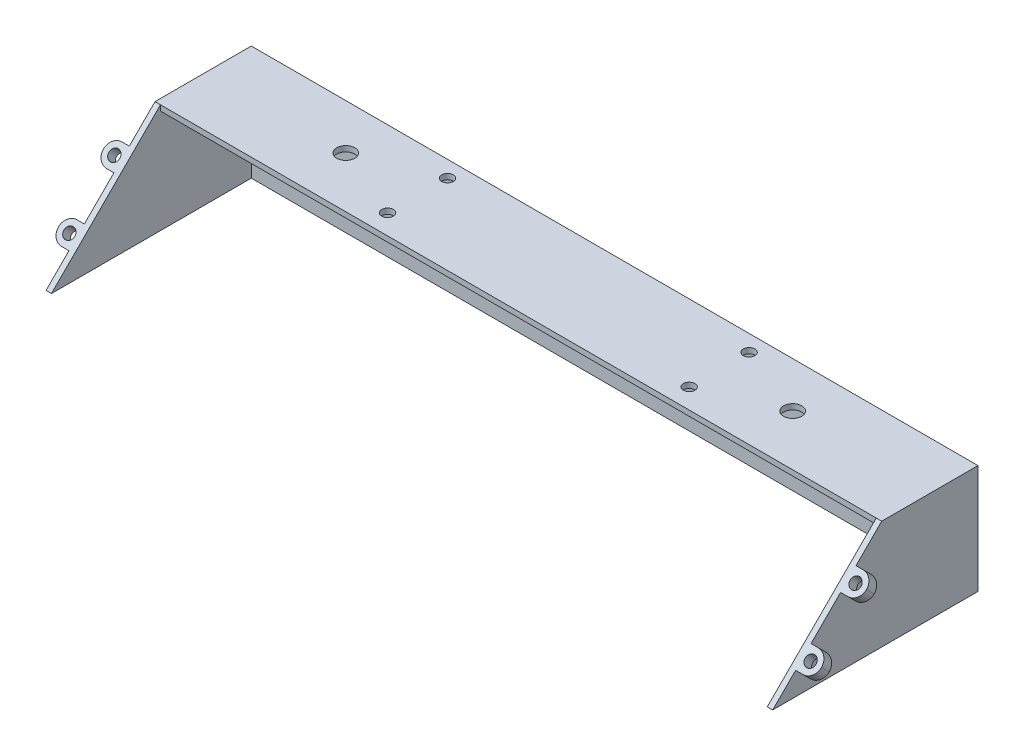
ISO-10303-21;
HEADER;
FILE_DESCRIPTION(('STEP AP214'),'2;1');
FILE_NAME('part.step','',(''),(''),'','','');
FILE_SCHEMA(('AUTOMOTIVE_DESIGN { 1 0 10303 214 1 1 1 1 }'));
ENDSEC;
DATA;
#1=APPLICATION_CONTEXT('core data for automotive mechanical design processes');
#2=APPLICATION_PROTOCOL_DEFINITION('international standard','automotive_design',2000,#1);
#3=PRODUCT_CONTEXT('',#1,'mechanical');
#4=PRODUCT('Part','Part','',(#3));
#5=PRODUCT_RELATED_PRODUCT_CATEGORY('part','',(#4));
#6=PRODUCT_DEFINITION_FORMATION('','',#4);
#7=PRODUCT_DEFINITION_CONTEXT('part definition',#1,'design');
#8=PRODUCT_DEFINITION('design','',#6,#7);
#9=PRODUCT_DEFINITION_SHAPE('','',#8);
#10=(LENGTH_UNIT() NAMED_UNIT(*) SI_UNIT(.MILLI.,.METRE.));
#11=(NAMED_UNIT(*) PLANE_ANGLE_UNIT() SI_UNIT($,.RADIAN.));
#12=(NAMED_UNIT(*) SI_UNIT($,.STERADIAN.) SOLID_ANGLE_UNIT());
#13=UNCERTAINTY_MEASURE_WITH_UNIT(LENGTH_MEASURE(1.E-05),#10,'distance_accuracy_value','');
#14=(GEOMETRIC_REPRESENTATION_CONTEXT(3) GLOBAL_UNCERTAINTY_ASSIGNED_CONTEXT((#13)) GLOBAL_UNIT_ASSIGNED_CONTEXT((#10,
#11,#12)) REPRESENTATION_CONTEXT('',''));
#15=CARTESIAN_POINT('',(0.,0.,0.));
#16=DIRECTION('',(0.,0.,1.));
#17=DIRECTION('',(1.,0.,0.));
#18=AXIS2_PLACEMENT_3D('',#15,#16,#17);
#19=CARTESIAN_POINT('',(-100.,15.,1.5));
#20=DIRECTION('',(1.,0.,0.));
#21=DIRECTION('',(0.,0.,-1.));
#22=AXIS2_PLACEMENT_3D('',#19,#20,#21);
#23=PLANE('',#22);
#24=DIRECTION('',(0.,-0.707106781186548,-0.707106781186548));
#25=VECTOR('',#24,1.);
#26=CARTESIAN_POINT('',(-100.,-6.57187564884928,43.82923496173));
#27=LINE('',#26,#25);
#28=CARTESIAN_POINT('',(-100.,-4.45055530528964,45.9505553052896));
#29=VERTEX_POINT('',#28);
#30=CARTESIAN_POINT('',(-100.,-6.57187564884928,43.82923496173));
#31=VERTEX_POINT('',#30);
#32=EDGE_CURVE('E294',#29,#31,#27,.T.);
#33=ORIENTED_EDGE('',*,*,#32,.F.);
#34=DIRECTION('',(0.,-0.707106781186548,0.707106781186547));
#35=VECTOR('',#34,1.);
#36=CARTESIAN_POINT('',(-100.,-15.,56.5));
#37=LINE('',#36,#35);
#38=CARTESIAN_POINT('',(-100.,3.68629150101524,37.8137084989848));
#39=VERTEX_POINT('',#38);
#40=EDGE_CURVE('E345',#39,#29,#37,.T.);
#41=ORIENTED_EDGE('',*,*,#40,.F.);
#42=DIRECTION('',(0.,0.707106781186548,0.707106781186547));
#43=VECTOR('',#42,1.);
#44=CARTESIAN_POINT('',(-100.,3.68629150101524,37.8137084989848));
#45=LINE('',#44,#43);
#46=CARTESIAN_POINT('',(-100.,1.5649711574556,35.6923881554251));
#47=VERTEX_POINT('',#46);
#48=EDGE_CURVE('E323',#47,#39,#45,.T.);
#49=ORIENTED_EDGE('',*,*,#48,.F.);
#50=DIRECTION('',(0.,-0.707106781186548,0.707106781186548));
#51=VECTOR('',#50,1.);
#52=CARTESIAN_POINT('',(-100.,1.5649711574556,35.6923881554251));
#53=LINE('',#52,#51);
#54=CARTESIAN_POINT('',(-100.,5.80761184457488,31.4497474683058));
#55=VERTEX_POINT('',#54);
#56=EDGE_CURVE('E319',#55,#47,#53,.T.);
#57=ORIENTED_EDGE('',*,*,#56,.F.);
#58=DIRECTION('',(0.,-0.707106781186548,-0.707106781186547));
#59=VECTOR('',#58,1.);
#60=CARTESIAN_POINT('',(-100.,5.80761184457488,31.4497474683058));
#61=LINE('',#60,#59);
#62=CARTESIAN_POINT('',(-100.,7.92893218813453,33.5710678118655));
#63=VERTEX_POINT('',#62);
#64=EDGE_CURVE('E316',#63,#55,#61,.T.);
#65=ORIENTED_EDGE('',*,*,#64,.F.);
#66=CARTESIAN_POINT('',(-100.,15.,26.5));
#67=VERTEX_POINT('',#66);
#68=EDGE_CURVE('E339',#67,#63,#37,.T.);
#69=ORIENTED_EDGE('',*,*,#68,.F.);
#70=DIRECTION('',(0.,0.,-1.));
#71=VECTOR('',#70,1.);
#72=CARTESIAN_POINT('',(-100.,15.,1.5));
#73=LINE('',#72,#71);
#74=CARTESIAN_POINT('',(-100.,15.,0.));
#75=VERTEX_POINT('',#74);
#76=EDGE_CURVE('E400',#67,#75,#73,.T.);
#77=ORIENTED_EDGE('',*,*,#76,.T.);
#78=DIRECTION('',(0.,-1.,0.));
#79=VECTOR('',#78,1.);
#80=CARTESIAN_POINT('',(-100.,15.,0.));
#81=LINE('',#80,#79);
#82=CARTESIAN_POINT('',(-100.,-15.,0.));
#83=VERTEX_POINT('',#82);
#84=EDGE_CURVE('E394',#75,#83,#81,.T.);
#85=ORIENTED_EDGE('',*,*,#84,.T.);
#86=DIRECTION('',(0.,0.,-1.));
#87=VECTOR('',#86,1.);
#88=CARTESIAN_POINT('',(-100.,-15.,1.5));
#89=LINE('',#88,#87);
#90=CARTESIAN_POINT('',(-100.,-15.,56.5));
#91=VERTEX_POINT('',#90);
#92=EDGE_CURVE('E354',#91,#83,#89,.T.);
#93=ORIENTED_EDGE('',*,*,#92,.F.);
#94=CARTESIAN_POINT('',(-100.,-8.69319599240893,50.1931959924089));
#95=VERTEX_POINT('',#94);
#96=EDGE_CURVE('E334',#95,#91,#37,.T.);
#97=ORIENTED_EDGE('',*,*,#96,.F.);
#98=DIRECTION('',(0.,0.707106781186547,0.707106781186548));
#99=VECTOR('',#98,1.);
#100=CARTESIAN_POINT('',(-100.,-8.69319599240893,50.1931959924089));
#101=LINE('',#100,#99);
#102=CARTESIAN_POINT('',(-100.,-10.8145163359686,48.0718756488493));
#103=VERTEX_POINT('',#102);
#104=EDGE_CURVE('E301',#103,#95,#101,.T.);
#105=ORIENTED_EDGE('',*,*,#104,.F.);
#106=DIRECTION('',(0.,-0.707106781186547,0.707106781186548));
#107=VECTOR('',#106,1.);
#108=CARTESIAN_POINT('',(-100.,-10.8145163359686,48.0718756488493));
#109=LINE('',#108,#107);
#110=EDGE_CURVE('E297',#31,#103,#109,.T.);
#111=ORIENTED_EDGE('',*,*,#110,.F.);
#112=EDGE_LOOP('',(#33,#41,#49,#57,#65,#69,#77,#85,#93,#97,#105,#111));
#113=FACE_BOUND('',#112,.T.);
#114=ADVANCED_FACE('F33',(#113),#23,.F.);
#115=CARTESIAN_POINT('',(0.,0.,26.5));
#116=DIRECTION('',(0.,0.,1.));
#117=DIRECTION('',(1.,0.,0.));
#118=AXIS2_PLACEMENT_3D('',#115,#116,#117);
#119=PLANE('',#118);
#120=DIRECTION('',(0.,1.,0.));
#121=VECTOR('',#120,1.);
#122=CARTESIAN_POINT('',(-98.5,15.,26.5));
#123=LINE('',#122,#121);
#124=CARTESIAN_POINT('',(-98.5,13.5,26.5));
#125=VERTEX_POINT('',#124);
#126=CARTESIAN_POINT('',(-98.5,15.,26.5));
#127=VERTEX_POINT('',#126);
#128=EDGE_CURVE('E335',#125,#127,#123,.T.);
#129=ORIENTED_EDGE('',*,*,#128,.F.);
#130=DIRECTION('',(1.,0.,0.));
#131=VECTOR('',#130,1.);
#132=CARTESIAN_POINT('',(-100.,13.5,26.5));
#133=LINE('',#132,#131);
#134=CARTESIAN_POINT('',(98.5,13.5,26.5));
#135=VERTEX_POINT('',#134);
#136=EDGE_CURVE('E387',#125,#135,#133,.T.);
#137=ORIENTED_EDGE('',*,*,#136,.T.);
#138=DIRECTION('',(0.,1.,0.));
#139=VECTOR('',#138,1.);
#140=CARTESIAN_POINT('',(98.5,15.,26.5));
#141=LINE('',#140,#139);
#142=CARTESIAN_POINT('',(98.5,15.,26.5));
#143=VERTEX_POINT('',#142);
#144=EDGE_CURVE('E350',#135,#143,#141,.T.);
#145=ORIENTED_EDGE('',*,*,#144,.T.);
#146=DIRECTION('',(-1.,0.,0.));
#147=VECTOR('',#146,1.);
#148=CARTESIAN_POINT('',(-100.,15.,26.5));
#149=LINE('',#148,#147);
#150=EDGE_CURVE('E390',#143,#127,#149,.T.);
#151=ORIENTED_EDGE('',*,*,#150,.T.);
#152=EDGE_LOOP('',(#129,#137,#145,#151));
#153=FACE_BOUND('',#152,.T.);
#154=ADVANCED_FACE('F553',(#153),#119,.T.);
#155=CARTESIAN_POINT('',(0.,0.,1.5));
#156=DIRECTION('',(0.,0.,1.));
#157=DIRECTION('',(1.,0.,0.));
#158=AXIS2_PLACEMENT_3D('',#155,#156,#157);
#159=PLANE('',#158);
#160=DIRECTION('',(0.,1.,0.));
#161=VECTOR('',#160,1.);
#162=CARTESIAN_POINT('',(98.5,-15.,1.5));
#163=LINE('',#162,#161);
#164=CARTESIAN_POINT('',(98.5,-15.,1.5));
#165=VERTEX_POINT('',#164);
#166=CARTESIAN_POINT('',(98.5,13.5,1.5));
#167=VERTEX_POINT('',#166);
#168=EDGE_CURVE('E373',#165,#167,#163,.T.);
#169=ORIENTED_EDGE('',*,*,#168,.T.);
#170=DIRECTION('',(1.,0.,0.));
#171=VECTOR('',#170,1.);
#172=CARTESIAN_POINT('',(-100.,13.5,1.5));
#173=LINE('',#172,#171);
#174=CARTESIAN_POINT('',(-98.5,13.5,1.5));
#175=VERTEX_POINT('',#174);
#176=EDGE_CURVE('E386',#175,#167,#173,.T.);
#177=ORIENTED_EDGE('',*,*,#176,.F.);
#178=DIRECTION('',(0.,1.,0.));
#179=VECTOR('',#178,1.);
#180=CARTESIAN_POINT('',(-98.5,-15.,1.5));
#181=LINE('',#180,#179);
#182=CARTESIAN_POINT('',(-98.5,-15.,1.5));
#183=VERTEX_POINT('',#182);
#184=EDGE_CURVE('E382',#183,#175,#181,.T.);
#185=ORIENTED_EDGE('',*,*,#184,.F.);
#186=DIRECTION('',(1.,0.,0.));
#187=VECTOR('',#186,1.);
#188=CARTESIAN_POINT('',(-100.,-15.,1.5));
#189=LINE('',#188,#187);
#190=EDGE_CURVE('E397',#183,#165,#189,.T.);
#191=ORIENTED_EDGE('',*,*,#190,.T.);
#192=EDGE_LOOP('',(#169,#177,#185,#191));
#193=FACE_BOUND('',#192,.T.);
#194=ADVANCED_FACE('F566',(#193),#159,.T.);
#195=CARTESIAN_POINT('',(-100.,13.5,26.5));
#196=DIRECTION('',(0.,1.,0.));
#197=DIRECTION('',(-1.,0.,0.));
#198=AXIS2_PLACEMENT_3D('',#195,#196,#197);
#199=PLANE('',#198);
#200=CARTESIAN_POINT('',(-41.5,13.5,4.5));
#201=DIRECTION('',(0.,1.,0.));
#202=DIRECTION('',(0.,0.,-1.));
#203=AXIS2_PLACEMENT_3D('',#200,#201,#202);
#204=CIRCLE('',#203,1.60000000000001);
#205=CARTESIAN_POINT('',(-41.5,13.5,2.9));
#206=VERTEX_POINT('',#205);
#207=EDGE_CURVE('E505',#206,#206,#204,.T.);
#208=ORIENTED_EDGE('',*,*,#207,.T.);
#209=EDGE_LOOP('',(#208));
#210=FACE_BOUND('',#209,.T.);
#211=CARTESIAN_POINT('',(-41.5,13.5,21.));
#212=DIRECTION('',(0.,1.,0.));
#213=DIRECTION('',(0.,0.,-1.));
#214=AXIS2_PLACEMENT_3D('',#211,#212,#213);
#215=CIRCLE('',#214,1.6);
#216=CARTESIAN_POINT('',(-41.5,13.5,19.4));
#217=VERTEX_POINT('',#216);
#218=EDGE_CURVE('E499',#217,#217,#215,.T.);
#219=ORIENTED_EDGE('',*,*,#218,.T.);
#220=EDGE_LOOP('',(#219));
#221=FACE_BOUND('',#220,.T.);
#222=CARTESIAN_POINT('',(-61.5,13.5,12.5));
#223=DIRECTION('',(0.,1.,0.));
#224=DIRECTION('',(0.,0.,-1.));
#225=AXIS2_PLACEMENT_3D('',#222,#223,#224);
#226=CIRCLE('',#225,2.5);
#227=CARTESIAN_POINT('',(-61.5,13.5,10.));
#228=VERTEX_POINT('',#227);
#229=EDGE_CURVE('E491',#228,#228,#226,.T.);
#230=ORIENTED_EDGE('',*,*,#229,.T.);
#231=EDGE_LOOP('',(#230));
#232=FACE_BOUND('',#231,.T.);
#233=CARTESIAN_POINT('',(41.5,13.5,21.));
#234=DIRECTION('',(0.,-1.,0.));
#235=DIRECTION('',(0.,0.,-1.));
#236=AXIS2_PLACEMENT_3D('',#233,#234,#235);
#237=CIRCLE('',#236,1.6);
#238=CARTESIAN_POINT('',(41.5,13.5,19.4));
#239=VERTEX_POINT('',#238);
#240=EDGE_CURVE('E360',#239,#239,#237,.T.);
#241=ORIENTED_EDGE('',*,*,#240,.F.);
#242=EDGE_LOOP('',(#241));
#243=FACE_BOUND('',#242,.T.);
#244=CARTESIAN_POINT('',(41.5,13.5,4.5));
#245=DIRECTION('',(0.,-1.,0.));
#246=DIRECTION('',(0.,0.,-1.));
#247=AXIS2_PLACEMENT_3D('',#244,#245,#246);
#248=CIRCLE('',#247,1.60000000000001);
#249=CARTESIAN_POINT('',(41.5,13.5,2.9));
#250=VERTEX_POINT('',#249);
#251=EDGE_CURVE('E359',#250,#250,#248,.T.);
#252=ORIENTED_EDGE('',*,*,#251,.F.);
#253=EDGE_LOOP('',(#252));
#254=FACE_BOUND('',#253,.T.);
#255=CARTESIAN_POINT('',(61.5,13.5,12.5));
#256=DIRECTION('',(0.,-1.,0.));
#257=DIRECTION('',(0.,0.,-1.));
#258=AXIS2_PLACEMENT_3D('',#255,#256,#257);
#259=CIRCLE('',#258,2.5);
#260=CARTESIAN_POINT('',(61.5,13.5,10.));
#261=VERTEX_POINT('',#260);
#262=EDGE_CURVE('E366',#261,#261,#259,.T.);
#263=ORIENTED_EDGE('',*,*,#262,.F.);
#264=EDGE_LOOP('',(#263));
#265=FACE_BOUND('',#264,.T.);
#266=ORIENTED_EDGE('',*,*,#176,.T.);
#267=DIRECTION('',(0.,0.,1.));
#268=VECTOR('',#267,1.);
#269=CARTESIAN_POINT('',(98.5,13.5,26.5));
#270=LINE('',#269,#268);
#271=EDGE_CURVE('E374',#167,#135,#270,.T.);
#272=ORIENTED_EDGE('',*,*,#271,.T.);
#273=ORIENTED_EDGE('',*,*,#136,.F.);
#274=DIRECTION('',(0.,0.,1.));
#275=VECTOR('',#274,1.);
#276=CARTESIAN_POINT('',(-98.5,13.5,26.5));
#277=LINE('',#276,#275);
#278=EDGE_CURVE('E379',#175,#125,#277,.T.);
#279=ORIENTED_EDGE('',*,*,#278,.F.);
#280=EDGE_LOOP('',(#266,#272,#273,#279));
#281=FACE_BOUND('',#280,.T.);
#282=ADVANCED_FACE('F509',(#210,#221,#232,#243,#254,#265,#281),#199,.F.);
#283=CARTESIAN_POINT('',(-100.,-15.,1.5));
#284=DIRECTION('',(0.,1.,0.));
#285=DIRECTION('',(0.,0.,1.));
#286=AXIS2_PLACEMENT_3D('',#283,#284,#285);
#287=PLANE('',#286);
#288=ORIENTED_EDGE('',*,*,#92,.T.);
#289=DIRECTION('',(1.,0.,0.));
#290=VECTOR('',#289,1.);
#291=CARTESIAN_POINT('',(-100.,-15.,0.));
#292=LINE('',#291,#290);
#293=CARTESIAN_POINT('',(100.,-15.,0.));
#294=VERTEX_POINT('',#293);
#295=EDGE_CURVE('E404',#83,#294,#292,.T.);
#296=ORIENTED_EDGE('',*,*,#295,.T.);
#297=DIRECTION('',(0.,0.,-1.));
#298=VECTOR('',#297,1.);
#299=CARTESIAN_POINT('',(100.,-15.,1.5));
#300=LINE('',#299,#298);
#301=CARTESIAN_POINT('',(100.,-15.,56.5));
#302=VERTEX_POINT('',#301);
#303=EDGE_CURVE('E414',#302,#294,#300,.T.);
#304=ORIENTED_EDGE('',*,*,#303,.F.);
#305=DIRECTION('',(1.,0.,0.));
#306=VECTOR('',#305,1.);
#307=CARTESIAN_POINT('',(98.5,-15.,56.5));
#308=LINE('',#307,#306);
#309=CARTESIAN_POINT('',(98.5,-15.,56.5));
#310=VERTEX_POINT('',#309);
#311=EDGE_CURVE('E243',#310,#302,#308,.T.);
#312=ORIENTED_EDGE('',*,*,#311,.F.);
#313=DIRECTION('',(0.,0.,1.));
#314=VECTOR('',#313,1.);
#315=CARTESIAN_POINT('',(98.5,-15.,26.5));
#316=LINE('',#315,#314);
#317=EDGE_CURVE('E371',#165,#310,#316,.T.);
#318=ORIENTED_EDGE('',*,*,#317,.F.);
#319=ORIENTED_EDGE('',*,*,#190,.F.);
#320=DIRECTION('',(0.,0.,1.));
#321=VECTOR('',#320,1.);
#322=CARTESIAN_POINT('',(-98.5,-15.,26.5));
#323=LINE('',#322,#321);
#324=CARTESIAN_POINT('',(-98.5,-15.,56.5));
#325=VERTEX_POINT('',#324);
#326=EDGE_CURVE('E380',#183,#325,#323,.T.);
#327=ORIENTED_EDGE('',*,*,#326,.T.);
#328=DIRECTION('',(-1.,0.,0.));
#329=VECTOR('',#328,1.);
#330=CARTESIAN_POINT('',(-98.5,-15.,56.5));
#331=LINE('',#330,#329);
#332=EDGE_CURVE('E342',#325,#91,#331,.T.);
#333=ORIENTED_EDGE('',*,*,#332,.T.);
#334=EDGE_LOOP('',(#288,#296,#304,#312,#318,#319,#327,#333));
#335=FACE_BOUND('',#334,.T.);
#336=ADVANCED_FACE('F560',(#335),#287,.F.);
#337=CARTESIAN_POINT('',(100.,15.,1.5));
#338=DIRECTION('',(-1.,0.,0.));
#339=DIRECTION('',(0.,0.,1.));
#340=AXIS2_PLACEMENT_3D('',#337,#338,#339);
#341=PLANE('',#340);
#342=DIRECTION('',(0.,-0.707106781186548,0.707106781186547));
#343=VECTOR('',#342,1.);
#344=CARTESIAN_POINT('',(100.,-15.,56.5));
#345=LINE('',#344,#343);
#346=CARTESIAN_POINT('',(100.,3.68629150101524,37.8137084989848));
#347=VERTEX_POINT('',#346);
#348=CARTESIAN_POINT('',(100.,-4.45055530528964,45.9505553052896));
#349=VERTEX_POINT('',#348);
#350=EDGE_CURVE('E247',#347,#349,#345,.T.);
#351=ORIENTED_EDGE('',*,*,#350,.T.);
#352=DIRECTION('',(0.,-0.707106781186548,-0.707106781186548));
#353=VECTOR('',#352,1.);
#354=CARTESIAN_POINT('',(100.,-6.57187564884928,43.82923496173));
#355=LINE('',#354,#353);
#356=CARTESIAN_POINT('',(100.,-6.57187564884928,43.82923496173));
#357=VERTEX_POINT('',#356);
#358=EDGE_CURVE('E257',#349,#357,#355,.T.);
#359=ORIENTED_EDGE('',*,*,#358,.T.);
#360=DIRECTION('',(0.,-0.707106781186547,0.707106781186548));
#361=VECTOR('',#360,1.);
#362=CARTESIAN_POINT('',(100.,-10.8145163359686,48.0718756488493));
#363=LINE('',#362,#361);
#364=CARTESIAN_POINT('',(100.,-10.8145163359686,48.0718756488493));
#365=VERTEX_POINT('',#364);
#366=EDGE_CURVE('E256',#357,#365,#363,.T.);
#367=ORIENTED_EDGE('',*,*,#366,.T.);
#368=DIRECTION('',(0.,0.707106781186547,0.707106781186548));
#369=VECTOR('',#368,1.);
#370=CARTESIAN_POINT('',(100.,-8.69319599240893,50.1931959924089));
#371=LINE('',#370,#369);
#372=CARTESIAN_POINT('',(100.,-8.69319599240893,50.1931959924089));
#373=VERTEX_POINT('',#372);
#374=EDGE_CURVE('E231',#365,#373,#371,.T.);
#375=ORIENTED_EDGE('',*,*,#374,.T.);
#376=EDGE_CURVE('E239',#373,#302,#345,.T.);
#377=ORIENTED_EDGE('',*,*,#376,.T.);
#378=ORIENTED_EDGE('',*,*,#303,.T.);
#379=DIRECTION('',(0.,1.,0.));
#380=VECTOR('',#379,1.);
#381=CARTESIAN_POINT('',(100.,15.,0.));
#382=LINE('',#381,#380);
#383=CARTESIAN_POINT('',(100.,15.,0.));
#384=VERTEX_POINT('',#383);
#385=EDGE_CURVE('E406',#294,#384,#382,.T.);
#386=ORIENTED_EDGE('',*,*,#385,.T.);
#387=DIRECTION('',(0.,0.,-1.));
#388=VECTOR('',#387,1.);
#389=CARTESIAN_POINT('',(100.,15.,1.5));
#390=LINE('',#389,#388);
#391=CARTESIAN_POINT('',(100.,15.,26.5));
#392=VERTEX_POINT('',#391);
#393=EDGE_CURVE('E412',#392,#384,#390,.T.);
#394=ORIENTED_EDGE('',*,*,#393,.F.);
#395=CARTESIAN_POINT('',(100.,7.92893218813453,33.5710678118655));
#396=VERTEX_POINT('',#395);
#397=EDGE_CURVE('E250',#392,#396,#345,.T.);
#398=ORIENTED_EDGE('',*,*,#397,.T.);
#399=DIRECTION('',(0.,-0.707106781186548,-0.707106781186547));
#400=VECTOR('',#399,1.);
#401=CARTESIAN_POINT('',(100.,5.80761184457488,31.4497474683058));
#402=LINE('',#401,#400);
#403=CARTESIAN_POINT('',(100.,5.80761184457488,31.4497474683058));
#404=VERTEX_POINT('',#403);
#405=EDGE_CURVE('E272',#396,#404,#402,.T.);
#406=ORIENTED_EDGE('',*,*,#405,.T.);
#407=DIRECTION('',(0.,-0.707106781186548,0.707106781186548));
#408=VECTOR('',#407,1.);
#409=CARTESIAN_POINT('',(100.,1.5649711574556,35.6923881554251));
#410=LINE('',#409,#408);
#411=CARTESIAN_POINT('',(100.,1.5649711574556,35.6923881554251));
#412=VERTEX_POINT('',#411);
#413=EDGE_CURVE('E279',#404,#412,#410,.T.);
#414=ORIENTED_EDGE('',*,*,#413,.T.);
#415=DIRECTION('',(0.,0.707106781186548,0.707106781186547));
#416=VECTOR('',#415,1.);
#417=CARTESIAN_POINT('',(100.,3.68629150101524,37.8137084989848));
#418=LINE('',#417,#416);
#419=EDGE_CURVE('E275',#412,#347,#418,.T.);
#420=ORIENTED_EDGE('',*,*,#419,.T.);
#421=EDGE_LOOP('',(#351,#359,#367,#375,#377,#378,#386,#394,#398,#406,#414,#420));
#422=FACE_BOUND('',#421,.T.);
#423=ADVANCED_FACE('F253',(#422),#341,.F.);
#424=CARTESIAN_POINT('',(-100.,15.,1.5));
#425=DIRECTION('',(0.,-1.,0.));
#426=DIRECTION('',(0.,0.,-1.));
#427=AXIS2_PLACEMENT_3D('',#424,#425,#426);
#428=PLANE('',#427);
#429=CARTESIAN_POINT('',(-41.5,15.,4.5));
#430=DIRECTION('',(0.,1.,0.));
#431=DIRECTION('',(0.,0.,-1.));
#432=AXIS2_PLACEMENT_3D('',#429,#430,#431);
#433=CIRCLE('',#432,1.60000000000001);
#434=CARTESIAN_POINT('',(-41.5,15.,2.9));
#435=VERTEX_POINT('',#434);
#436=EDGE_CURVE('E502',#435,#435,#433,.T.);
#437=ORIENTED_EDGE('',*,*,#436,.F.);
#438=EDGE_LOOP('',(#437));
#439=FACE_BOUND('',#438,.T.);
#440=CARTESIAN_POINT('',(-41.5,15.,21.));
#441=DIRECTION('',(0.,1.,0.));
#442=DIRECTION('',(0.,0.,-1.));
#443=AXIS2_PLACEMENT_3D('',#440,#441,#442);
#444=CIRCLE('',#443,1.6);
#445=CARTESIAN_POINT('',(-41.5,15.,19.4));
#446=VERTEX_POINT('',#445);
#447=EDGE_CURVE('E496',#446,#446,#444,.T.);
#448=ORIENTED_EDGE('',*,*,#447,.F.);
#449=EDGE_LOOP('',(#448));
#450=FACE_BOUND('',#449,.T.);
#451=CARTESIAN_POINT('',(-61.5,15.,12.5));
#452=DIRECTION('',(0.,1.,0.));
#453=DIRECTION('',(0.,0.,-1.));
#454=AXIS2_PLACEMENT_3D('',#451,#452,#453);
#455=CIRCLE('',#454,2.5);
#456=CARTESIAN_POINT('',(-61.5,15.,10.));
#457=VERTEX_POINT('',#456);
#458=EDGE_CURVE('E487',#457,#457,#455,.T.);
#459=ORIENTED_EDGE('',*,*,#458,.F.);
#460=EDGE_LOOP('',(#459));
#461=FACE_BOUND('',#460,.T.);
#462=CARTESIAN_POINT('',(41.5,15.,21.));
#463=DIRECTION('',(0.,-1.,0.));
#464=DIRECTION('',(0.,0.,-1.));
#465=AXIS2_PLACEMENT_3D('',#462,#463,#464);
#466=CIRCLE('',#465,1.6);
#467=CARTESIAN_POINT('',(41.5,15.,19.4));
#468=VERTEX_POINT('',#467);
#469=EDGE_CURVE('E370',#468,#468,#466,.T.);
#470=ORIENTED_EDGE('',*,*,#469,.T.);
#471=EDGE_LOOP('',(#470));
#472=FACE_BOUND('',#471,.T.);
#473=CARTESIAN_POINT('',(41.5,15.,4.5));
#474=DIRECTION('',(0.,-1.,0.));
#475=DIRECTION('',(0.,0.,-1.));
#476=AXIS2_PLACEMENT_3D('',#473,#474,#475);
#477=CIRCLE('',#476,1.60000000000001);
#478=CARTESIAN_POINT('',(41.5,15.,2.9));
#479=VERTEX_POINT('',#478);
#480=EDGE_CURVE('E363',#479,#479,#477,.T.);
#481=ORIENTED_EDGE('',*,*,#480,.T.);
#482=EDGE_LOOP('',(#481));
#483=FACE_BOUND('',#482,.T.);
#484=CARTESIAN_POINT('',(61.5,15.,12.5));
#485=DIRECTION('',(0.,-1.,0.));
#486=DIRECTION('',(0.,0.,-1.));
#487=AXIS2_PLACEMENT_3D('',#484,#485,#486);
#488=CIRCLE('',#487,2.5);
#489=CARTESIAN_POINT('',(61.5,15.,10.));
#490=VERTEX_POINT('',#489);
#491=EDGE_CURVE('E369',#490,#490,#488,.T.);
#492=ORIENTED_EDGE('',*,*,#491,.T.);
#493=EDGE_LOOP('',(#492));
#494=FACE_BOUND('',#493,.T.);
#495=ORIENTED_EDGE('',*,*,#393,.T.);
#496=DIRECTION('',(-1.,0.,0.));
#497=VECTOR('',#496,1.);
#498=CARTESIAN_POINT('',(-100.,15.,0.));
#499=LINE('',#498,#497);
#500=EDGE_CURVE('E401',#384,#75,#499,.T.);
#501=ORIENTED_EDGE('',*,*,#500,.T.);
#502=ORIENTED_EDGE('',*,*,#76,.F.);
#503=DIRECTION('',(-1.,0.,0.));
#504=VECTOR('',#503,1.);
#505=CARTESIAN_POINT('',(-98.5,15.,26.5));
#506=LINE('',#505,#504);
#507=EDGE_CURVE('E248',#127,#67,#506,.T.);
#508=ORIENTED_EDGE('',*,*,#507,.F.);
#509=ORIENTED_EDGE('',*,*,#150,.F.);
#510=EDGE_CURVE('E391',#392,#143,#149,.T.);
#511=ORIENTED_EDGE('',*,*,#510,.F.);
#512=EDGE_LOOP('',(#495,#501,#502,#508,#509,#511));
#513=FACE_BOUND('',#512,.T.);
#514=ADVANCED_FACE('F519',(#439,#450,#461,#472,#483,#494,#513),#428,.F.);
#515=CARTESIAN_POINT('',(0.,0.,0.));
#516=DIRECTION('',(0.,0.,1.));
#517=DIRECTION('',(1.,0.,0.));
#518=AXIS2_PLACEMENT_3D('',#515,#516,#517);
#519=PLANE('',#518);
#520=ORIENTED_EDGE('',*,*,#84,.F.);
#521=ORIENTED_EDGE('',*,*,#500,.F.);
#522=ORIENTED_EDGE('',*,*,#385,.F.);
#523=ORIENTED_EDGE('',*,*,#295,.F.);
#524=EDGE_LOOP('',(#520,#521,#522,#523));
#525=FACE_BOUND('',#524,.T.);
#526=ADVANCED_FACE('F522',(#525),#519,.F.);
#527=CARTESIAN_POINT('',(-98.5,-15.,26.5));
#528=DIRECTION('',(-1.,0.,0.));
#529=DIRECTION('',(0.,-1.,0.));
#530=AXIS2_PLACEMENT_3D('',#527,#528,#529);
#531=PLANE('',#530);
#532=ORIENTED_EDGE('',*,*,#278,.T.);
#533=ORIENTED_EDGE('',*,*,#128,.T.);
#534=DIRECTION('',(0.,-0.707106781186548,0.707106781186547));
#535=VECTOR('',#534,1.);
#536=CARTESIAN_POINT('',(-98.5,-15.,56.5));
#537=LINE('',#536,#535);
#538=EDGE_CURVE('E338',#127,#325,#537,.T.);
#539=ORIENTED_EDGE('',*,*,#538,.T.);
#540=ORIENTED_EDGE('',*,*,#326,.F.);
#541=ORIENTED_EDGE('',*,*,#184,.T.);
#542=EDGE_LOOP('',(#532,#533,#539,#540,#541));
#543=FACE_BOUND('',#542,.T.);
#544=ADVANCED_FACE('F555',(#543),#531,.F.);
#545=CARTESIAN_POINT('',(98.5,-15.,26.5));
#546=DIRECTION('',(-1.,0.,0.));
#547=DIRECTION('',(0.,-1.,0.));
#548=AXIS2_PLACEMENT_3D('',#545,#546,#547);
#549=PLANE('',#548);
#550=ORIENTED_EDGE('',*,*,#271,.F.);
#551=ORIENTED_EDGE('',*,*,#168,.F.);
#552=ORIENTED_EDGE('',*,*,#317,.T.);
#553=DIRECTION('',(0.,-0.707106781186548,0.707106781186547));
#554=VECTOR('',#553,1.);
#555=CARTESIAN_POINT('',(98.5,-15.,56.5));
#556=LINE('',#555,#554);
#557=EDGE_CURVE('E355',#143,#310,#556,.T.);
#558=ORIENTED_EDGE('',*,*,#557,.F.);
#559=ORIENTED_EDGE('',*,*,#144,.F.);
#560=EDGE_LOOP('',(#550,#551,#552,#558,#559));
#561=FACE_BOUND('',#560,.T.);
#562=ADVANCED_FACE('F569',(#561),#549,.T.);
#563=CARTESIAN_POINT('',(61.5,19.,12.5));
#564=DIRECTION('',(0.,-1.,0.));
#565=DIRECTION('',(0.,0.,-1.));
#566=AXIS2_PLACEMENT_3D('',#563,#564,#565);
#567=CYLINDRICAL_SURFACE('',#566,2.5);
#568=ORIENTED_EDGE('',*,*,#262,.T.);
#569=EDGE_LOOP('',(#568));
#570=FACE_BOUND('',#569,.T.);
#571=ORIENTED_EDGE('',*,*,#491,.F.);
#572=EDGE_LOOP('',(#571));
#573=FACE_BOUND('',#572,.T.);
#574=ADVANCED_FACE('F670',(#570,#573),#567,.F.);
#575=CARTESIAN_POINT('',(41.5,23.5,4.5));
#576=DIRECTION('',(0.,-1.,0.));
#577=DIRECTION('',(0.,0.,-1.));
#578=AXIS2_PLACEMENT_3D('',#575,#576,#577);
#579=CYLINDRICAL_SURFACE('',#578,1.60000000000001);
#580=ORIENTED_EDGE('',*,*,#251,.T.);
#581=EDGE_LOOP('',(#580));
#582=FACE_BOUND('',#581,.T.);
#583=ORIENTED_EDGE('',*,*,#480,.F.);
#584=EDGE_LOOP('',(#583));
#585=FACE_BOUND('',#584,.T.);
#586=ADVANCED_FACE('F673',(#582,#585),#579,.F.);
#587=CARTESIAN_POINT('',(41.5,23.5,21.));
#588=DIRECTION('',(0.,-1.,0.));
#589=DIRECTION('',(0.,0.,-1.));
#590=AXIS2_PLACEMENT_3D('',#587,#588,#589);
#591=CYLINDRICAL_SURFACE('',#590,1.6);
#592=ORIENTED_EDGE('',*,*,#240,.T.);
#593=EDGE_LOOP('',(#592));
#594=FACE_BOUND('',#593,.T.);
#595=ORIENTED_EDGE('',*,*,#469,.F.);
#596=EDGE_LOOP('',(#595));
#597=FACE_BOUND('',#596,.T.);
#598=ADVANCED_FACE('F679',(#594,#597),#591,.F.);
#599=CARTESIAN_POINT('',(98.5,-15.,56.5));
#600=DIRECTION('',(0.,0.707106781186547,0.707106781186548));
#601=DIRECTION('',(0.,-0.707106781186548,0.707106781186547));
#602=AXIS2_PLACEMENT_3D('',#599,#600,#601);
#603=PLANE('',#602);
#604=CARTESIAN_POINT('',(102.,-6.57187564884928,48.0718756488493));
#605=DIRECTION('',(0.,-0.707106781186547,-0.707106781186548));
#606=DIRECTION('',(0.,-0.707106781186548,0.707106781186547));
#607=AXIS2_PLACEMENT_3D('',#604,#605,#606);
#608=CIRCLE('',#607,1.5);
#609=CARTESIAN_POINT('',(102.,-7.6325358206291,49.1325358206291));
#610=VERTEX_POINT('',#609);
#611=EDGE_CURVE('E483',#610,#610,#608,.T.);
#612=ORIENTED_EDGE('',*,*,#611,.T.);
#613=EDGE_LOOP('',(#612));
#614=FACE_BOUND('',#613,.T.);
#615=CARTESIAN_POINT('',(102.,5.80761184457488,35.6923881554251));
#616=DIRECTION('',(0.,-0.707106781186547,-0.707106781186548));
#617=DIRECTION('',(0.,-0.707106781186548,0.707106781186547));
#618=AXIS2_PLACEMENT_3D('',#615,#616,#617);
#619=CIRCLE('',#618,1.5);
#620=CARTESIAN_POINT('',(102.,4.74695167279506,36.7530483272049));
#621=VERTEX_POINT('',#620);
#622=EDGE_CURVE('E268',#621,#621,#619,.T.);
#623=ORIENTED_EDGE('',*,*,#622,.T.);
#624=EDGE_LOOP('',(#623));
#625=FACE_BOUND('',#624,.T.);
#626=DIRECTION('',(-1.,0.,0.));
#627=VECTOR('',#626,1.);
#628=CARTESIAN_POINT('',(105.,-8.69319599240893,50.1931959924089));
#629=LINE('',#628,#627);
#630=CARTESIAN_POINT('',(102.,-8.69319599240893,50.1931959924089));
#631=VERTEX_POINT('',#630);
#632=EDGE_CURVE('E226',#631,#373,#629,.T.);
#633=ORIENTED_EDGE('',*,*,#632,.F.);
#634=CARTESIAN_POINT('',(102.,-6.57187564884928,48.0718756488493));
#635=DIRECTION('',(0.,0.707106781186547,0.707106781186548));
#636=DIRECTION('',(0.,-0.707106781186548,0.707106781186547));
#637=AXIS2_PLACEMENT_3D('',#634,#635,#636);
#638=CIRCLE('',#637,3.);
#639=CARTESIAN_POINT('',(105.,-6.57187564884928,48.0718756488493));
#640=VERTEX_POINT('',#639);
#641=EDGE_CURVE('E476',#631,#640,#638,.T.);
#642=ORIENTED_EDGE('',*,*,#641,.T.);
#643=CARTESIAN_POINT('',(102.,-6.57187564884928,48.0718756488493));
#644=DIRECTION('',(0.,0.707106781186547,0.707106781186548));
#645=DIRECTION('',(0.,-0.707106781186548,0.707106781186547));
#646=AXIS2_PLACEMENT_3D('',#643,#644,#645);
#647=CIRCLE('',#646,3.);
#648=CARTESIAN_POINT('',(102.,-4.45055530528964,45.9505553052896));
#649=VERTEX_POINT('',#648);
#650=EDGE_CURVE('E474',#640,#649,#647,.T.);
#651=ORIENTED_EDGE('',*,*,#650,.T.);
#652=DIRECTION('',(-1.,0.,0.));
#653=VECTOR('',#652,1.);
#654=CARTESIAN_POINT('',(105.,-4.45055530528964,45.9505553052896));
#655=LINE('',#654,#653);
#656=EDGE_CURVE('E235',#649,#349,#655,.T.);
#657=ORIENTED_EDGE('',*,*,#656,.T.);
#658=ORIENTED_EDGE('',*,*,#350,.F.);
#659=DIRECTION('',(-1.,0.,0.));
#660=VECTOR('',#659,1.);
#661=CARTESIAN_POINT('',(105.,3.68629150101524,37.8137084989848));
#662=LINE('',#661,#660);
#663=CARTESIAN_POINT('',(102.,3.68629150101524,37.8137084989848));
#664=VERTEX_POINT('',#663);
#665=EDGE_CURVE('E286',#664,#347,#662,.T.);
#666=ORIENTED_EDGE('',*,*,#665,.F.);
#667=CARTESIAN_POINT('',(102.,5.80761184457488,35.6923881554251));
#668=DIRECTION('',(0.,0.707106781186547,0.707106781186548));
#669=DIRECTION('',(0.,-0.707106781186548,0.707106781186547));
#670=AXIS2_PLACEMENT_3D('',#667,#668,#669);
#671=CIRCLE('',#670,3.);
#672=CARTESIAN_POINT('',(105.,5.80761184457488,35.6923881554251));
#673=VERTEX_POINT('',#672);
#674=EDGE_CURVE('E461',#664,#673,#671,.T.);
#675=ORIENTED_EDGE('',*,*,#674,.T.);
#676=CARTESIAN_POINT('',(102.,5.80761184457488,35.6923881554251));
#677=DIRECTION('',(0.,0.707106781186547,0.707106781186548));
#678=DIRECTION('',(0.,-0.707106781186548,0.707106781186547));
#679=AXIS2_PLACEMENT_3D('',#676,#677,#678);
#680=CIRCLE('',#679,3.);
#681=CARTESIAN_POINT('',(102.,7.92893218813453,33.5710678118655));
#682=VERTEX_POINT('',#681);
#683=EDGE_CURVE('E459',#673,#682,#680,.T.);
#684=ORIENTED_EDGE('',*,*,#683,.T.);
#685=DIRECTION('',(-1.,0.,0.));
#686=VECTOR('',#685,1.);
#687=CARTESIAN_POINT('',(105.,7.92893218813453,33.5710678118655));
#688=LINE('',#687,#686);
#689=EDGE_CURVE('E288',#682,#396,#688,.T.);
#690=ORIENTED_EDGE('',*,*,#689,.T.);
#691=ORIENTED_EDGE('',*,*,#397,.F.);
#692=ORIENTED_EDGE('',*,*,#510,.T.);
#693=ORIENTED_EDGE('',*,*,#557,.T.);
#694=ORIENTED_EDGE('',*,*,#311,.T.);
#695=ORIENTED_EDGE('',*,*,#376,.F.);
#696=EDGE_LOOP('',(#633,#642,#651,#657,#658,#666,#675,#684,#690,#691,#692,#693,#694,#695));
#697=FACE_BOUND('',#696,.T.);
#698=ADVANCED_FACE('F240',(#614,#625,#697),#603,.T.);
#699=CARTESIAN_POINT('',(-98.5,-15.,56.5));
#700=DIRECTION('',(0.,-0.707106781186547,-0.707106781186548));
#701=DIRECTION('',(0.,0.707106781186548,-0.707106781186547));
#702=AXIS2_PLACEMENT_3D('',#699,#700,#701);
#703=PLANE('',#702);
#704=CARTESIAN_POINT('',(-102.,-6.57187564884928,48.0718756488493));
#705=DIRECTION('',(0.,0.707106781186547,0.707106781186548));
#706=DIRECTION('',(0.,-0.707106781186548,0.707106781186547));
#707=AXIS2_PLACEMENT_3D('',#704,#705,#706);
#708=CIRCLE('',#707,1.5);
#709=CARTESIAN_POINT('',(-102.,-7.6325358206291,49.1325358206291));
#710=VERTEX_POINT('',#709);
#711=EDGE_CURVE('E290',#710,#710,#708,.T.);
#712=ORIENTED_EDGE('',*,*,#711,.F.);
#713=EDGE_LOOP('',(#712));
#714=FACE_BOUND('',#713,.T.);
#715=CARTESIAN_POINT('',(-102.,5.80761184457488,35.6923881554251));
#716=DIRECTION('',(0.,0.707106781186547,0.707106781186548));
#717=DIRECTION('',(0.,-0.707106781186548,0.707106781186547));
#718=AXIS2_PLACEMENT_3D('',#715,#716,#717);
#719=CIRCLE('',#718,1.5);
#720=CARTESIAN_POINT('',(-102.,4.74695167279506,36.7530483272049));
#721=VERTEX_POINT('',#720);
#722=EDGE_CURVE('E312',#721,#721,#719,.T.);
#723=ORIENTED_EDGE('',*,*,#722,.F.);
#724=EDGE_LOOP('',(#723));
#725=FACE_BOUND('',#724,.T.);
#726=CARTESIAN_POINT('',(-102.,-6.57187564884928,48.0718756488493));
#727=DIRECTION('',(0.,-0.707106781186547,-0.707106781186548));
#728=DIRECTION('',(0.,0.707106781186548,-0.707106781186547));
#729=AXIS2_PLACEMENT_3D('',#726,#727,#728);
#730=CIRCLE('',#729,3.);
#731=CARTESIAN_POINT('',(-102.,-4.45055530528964,45.9505553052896));
#732=VERTEX_POINT('',#731);
#733=CARTESIAN_POINT('',(-105.,-6.57187564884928,48.0718756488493));
#734=VERTEX_POINT('',#733);
#735=EDGE_CURVE('E435',#732,#734,#730,.F.);
#736=ORIENTED_EDGE('',*,*,#735,.T.);
#737=CARTESIAN_POINT('',(-102.,-6.57187564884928,48.0718756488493));
#738=DIRECTION('',(0.,-0.707106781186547,-0.707106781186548));
#739=DIRECTION('',(0.,0.707106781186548,-0.707106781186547));
#740=AXIS2_PLACEMENT_3D('',#737,#738,#739);
#741=CIRCLE('',#740,3.);
#742=CARTESIAN_POINT('',(-102.,-8.69319599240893,50.1931959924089));
#743=VERTEX_POINT('',#742);
#744=EDGE_CURVE('E441',#734,#743,#741,.F.);
#745=ORIENTED_EDGE('',*,*,#744,.T.);
#746=DIRECTION('',(1.,0.,0.));
#747=VECTOR('',#746,1.);
#748=CARTESIAN_POINT('',(-105.,-8.69319599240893,50.1931959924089));
#749=LINE('',#748,#747);
#750=EDGE_CURVE('E306',#743,#95,#749,.T.);
#751=ORIENTED_EDGE('',*,*,#750,.T.);
#752=ORIENTED_EDGE('',*,*,#96,.T.);
#753=ORIENTED_EDGE('',*,*,#332,.F.);
#754=ORIENTED_EDGE('',*,*,#538,.F.);
#755=ORIENTED_EDGE('',*,*,#507,.T.);
#756=ORIENTED_EDGE('',*,*,#68,.T.);
#757=DIRECTION('',(1.,0.,0.));
#758=VECTOR('',#757,1.);
#759=CARTESIAN_POINT('',(-105.,7.92893218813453,33.5710678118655));
#760=LINE('',#759,#758);
#761=CARTESIAN_POINT('',(-102.,7.92893218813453,33.5710678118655));
#762=VERTEX_POINT('',#761);
#763=EDGE_CURVE('E326',#762,#63,#760,.T.);
#764=ORIENTED_EDGE('',*,*,#763,.F.);
#765=CARTESIAN_POINT('',(-102.,5.80761184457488,35.6923881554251));
#766=DIRECTION('',(0.,-0.707106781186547,-0.707106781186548));
#767=DIRECTION('',(0.,0.707106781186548,-0.707106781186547));
#768=AXIS2_PLACEMENT_3D('',#765,#766,#767);
#769=CIRCLE('',#768,3.);
#770=CARTESIAN_POINT('',(-105.,5.80761184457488,35.6923881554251));
#771=VERTEX_POINT('',#770);
#772=EDGE_CURVE('E353',#762,#771,#769,.F.);
#773=ORIENTED_EDGE('',*,*,#772,.T.);
#774=CARTESIAN_POINT('',(-102.,5.80761184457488,35.6923881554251));
#775=DIRECTION('',(0.,-0.707106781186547,-0.707106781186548));
#776=DIRECTION('',(0.,0.707106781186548,-0.707106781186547));
#777=AXIS2_PLACEMENT_3D('',#774,#775,#776);
#778=CIRCLE('',#777,3.);
#779=CARTESIAN_POINT('',(-102.,3.68629150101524,37.8137084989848));
#780=VERTEX_POINT('',#779);
#781=EDGE_CURVE('E424',#771,#780,#778,.F.);
#782=ORIENTED_EDGE('',*,*,#781,.T.);
#783=DIRECTION('',(1.,0.,0.));
#784=VECTOR('',#783,1.);
#785=CARTESIAN_POINT('',(-105.,3.68629150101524,37.8137084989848));
#786=LINE('',#785,#784);
#787=EDGE_CURVE('E328',#780,#39,#786,.T.);
#788=ORIENTED_EDGE('',*,*,#787,.T.);
#789=ORIENTED_EDGE('',*,*,#40,.T.);
#790=DIRECTION('',(1.,0.,0.));
#791=VECTOR('',#790,1.);
#792=CARTESIAN_POINT('',(-105.,-4.45055530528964,45.9505553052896));
#793=LINE('',#792,#791);
#794=EDGE_CURVE('E304',#732,#29,#793,.T.);
#795=ORIENTED_EDGE('',*,*,#794,.F.);
#796=EDGE_LOOP('',(#736,#745,#751,#752,#753,#754,#755,#756,#764,#773,#782,#788,#789,#795));
#797=FACE_BOUND('',#796,.T.);
#798=ADVANCED_FACE('F558',(#714,#725,#797),#703,.F.);
#799=CARTESIAN_POINT('',(-105.,5.80761184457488,31.4497474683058));
#800=DIRECTION('',(0.,-0.707106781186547,0.707106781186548));
#801=DIRECTION('',(0.,-0.707106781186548,-0.707106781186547));
#802=AXIS2_PLACEMENT_3D('',#799,#800,#801);
#803=PLANE('',#802);
#804=DIRECTION('',(1.,0.,0.));
#805=VECTOR('',#804,1.);
#806=CARTESIAN_POINT('',(-105.,5.80761184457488,31.4497474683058));
#807=LINE('',#806,#805);
#808=CARTESIAN_POINT('',(-102.,5.80761184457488,31.4497474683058));
#809=VERTEX_POINT('',#808);
#810=EDGE_CURVE('E332',#809,#55,#807,.T.);
#811=ORIENTED_EDGE('',*,*,#810,.F.);
#812=DIRECTION('',(0.,-0.707106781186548,-0.707106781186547));
#813=VECTOR('',#812,1.);
#814=CARTESIAN_POINT('',(-102.,5.80761184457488,31.4497474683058));
#815=LINE('',#814,#813);
#816=EDGE_CURVE('E433',#809,#762,#815,.F.);
#817=ORIENTED_EDGE('',*,*,#816,.T.);
#818=ORIENTED_EDGE('',*,*,#763,.T.);
#819=ORIENTED_EDGE('',*,*,#64,.T.);
#820=EDGE_LOOP('',(#811,#817,#818,#819));
#821=FACE_BOUND('',#820,.T.);
#822=ADVANCED_FACE('F783',(#821),#803,.F.);
#823=CARTESIAN_POINT('',(-105.,1.5649711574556,35.6923881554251));
#824=DIRECTION('',(0.,0.707106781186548,0.707106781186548));
#825=DIRECTION('',(0.,-0.707106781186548,0.707106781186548));
#826=AXIS2_PLACEMENT_3D('',#823,#824,#825);
#827=PLANE('',#826);
#828=CARTESIAN_POINT('',(-102.,3.68629150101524,33.5710678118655));
#829=DIRECTION('',(0.,0.707106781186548,0.707106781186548));
#830=DIRECTION('',(0.,-0.707106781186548,0.707106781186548));
#831=AXIS2_PLACEMENT_3D('',#828,#829,#830);
#832=CIRCLE('',#831,1.5);
#833=CARTESIAN_POINT('',(-102.,2.62563132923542,34.6317279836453));
#834=VERTEX_POINT('',#833);
#835=EDGE_CURVE('E315',#834,#834,#832,.T.);
#836=ORIENTED_EDGE('',*,*,#835,.T.);
#837=EDGE_LOOP('',(#836));
#838=FACE_BOUND('',#837,.T.);
#839=DIRECTION('',(1.,0.,0.));
#840=VECTOR('',#839,1.);
#841=CARTESIAN_POINT('',(-105.,1.5649711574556,35.6923881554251));
#842=LINE('',#841,#840);
#843=CARTESIAN_POINT('',(-102.,1.5649711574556,35.6923881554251));
#844=VERTEX_POINT('',#843);
#845=EDGE_CURVE('E330',#844,#47,#842,.T.);
#846=ORIENTED_EDGE('',*,*,#845,.F.);
#847=CARTESIAN_POINT('',(-102.,3.68629150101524,33.5710678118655));
#848=DIRECTION('',(0.,0.707106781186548,0.707106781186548));
#849=DIRECTION('',(0.,-0.707106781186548,0.707106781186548));
#850=AXIS2_PLACEMENT_3D('',#847,#848,#849);
#851=CIRCLE('',#850,3.);
#852=CARTESIAN_POINT('',(-105.,3.68629150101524,33.5710678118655));
#853=VERTEX_POINT('',#852);
#854=EDGE_CURVE('E431',#844,#853,#851,.F.);
#855=ORIENTED_EDGE('',*,*,#854,.T.);
#856=CARTESIAN_POINT('',(-102.,3.68629150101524,33.5710678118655));
#857=DIRECTION('',(0.,0.707106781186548,0.707106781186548));
#858=DIRECTION('',(0.,-0.707106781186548,0.707106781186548));
#859=AXIS2_PLACEMENT_3D('',#856,#857,#858);
#860=CIRCLE('',#859,3.);
#861=EDGE_CURVE('E429',#853,#809,#860,.F.);
#862=ORIENTED_EDGE('',*,*,#861,.T.);
#863=ORIENTED_EDGE('',*,*,#810,.T.);
#864=ORIENTED_EDGE('',*,*,#56,.T.);
#865=EDGE_LOOP('',(#846,#855,#862,#863,#864));
#866=FACE_BOUND('',#865,.T.);
#867=ADVANCED_FACE('F799',(#838,#866),#827,.F.);
#868=CARTESIAN_POINT('',(-105.,3.68629150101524,37.8137084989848));
#869=DIRECTION('',(0.,0.707106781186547,-0.707106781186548));
#870=DIRECTION('',(0.,0.707106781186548,0.707106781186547));
#871=AXIS2_PLACEMENT_3D('',#868,#869,#870);
#872=PLANE('',#871);
#873=ORIENTED_EDGE('',*,*,#787,.F.);
#874=DIRECTION('',(0.,0.707106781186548,0.707106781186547));
#875=VECTOR('',#874,1.);
#876=CARTESIAN_POINT('',(-102.,3.68629150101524,37.8137084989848));
#877=LINE('',#876,#875);
#878=EDGE_CURVE('E426',#780,#844,#877,.F.);
#879=ORIENTED_EDGE('',*,*,#878,.T.);
#880=ORIENTED_EDGE('',*,*,#845,.T.);
#881=ORIENTED_EDGE('',*,*,#48,.T.);
#882=EDGE_LOOP('',(#873,#879,#880,#881));
#883=FACE_BOUND('',#882,.T.);
#884=ADVANCED_FACE('F619',(#883),#872,.F.);
#885=CARTESIAN_POINT('',(-102.,-14.9423881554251,14.9423881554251));
#886=DIRECTION('',(0.,-0.707106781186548,-0.707106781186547));
#887=DIRECTION('',(0.,0.707106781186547,-0.707106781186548));
#888=AXIS2_PLACEMENT_3D('',#885,#886,#887);
#889=CYLINDRICAL_SURFACE('',#888,3.);
#890=ORIENTED_EDGE('',*,*,#816,.F.);
#891=ORIENTED_EDGE('',*,*,#861,.F.);
#892=DIRECTION('',(0.,-0.707106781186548,-0.707106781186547));
#893=VECTOR('',#892,1.);
#894=CARTESIAN_POINT('',(-105.,-14.9423881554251,14.9423881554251));
#895=LINE('',#894,#893);
#896=EDGE_CURVE('E320',#771,#853,#895,.T.);
#897=ORIENTED_EDGE('',*,*,#896,.F.);
#898=ORIENTED_EDGE('',*,*,#772,.F.);
#899=EDGE_LOOP('',(#890,#891,#897,#898));
#900=FACE_BOUND('',#899,.T.);
#901=ADVANCED_FACE('F615',(#900),#889,.T.);
#902=CARTESIAN_POINT('',(-102.,-14.9423881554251,14.9423881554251));
#903=DIRECTION('',(0.,0.707106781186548,0.707106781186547));
#904=DIRECTION('',(0.,-0.707106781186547,0.707106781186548));
#905=AXIS2_PLACEMENT_3D('',#902,#903,#904);
#906=CYLINDRICAL_SURFACE('',#905,3.);
#907=ORIENTED_EDGE('',*,*,#854,.F.);
#908=ORIENTED_EDGE('',*,*,#878,.F.);
#909=ORIENTED_EDGE('',*,*,#781,.F.);
#910=ORIENTED_EDGE('',*,*,#896,.T.);
#911=EDGE_LOOP('',(#907,#908,#909,#910));
#912=FACE_BOUND('',#911,.T.);
#913=ADVANCED_FACE('F611',(#912),#906,.T.);
#914=CARTESIAN_POINT('',(-102.,2.27207793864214,32.1568542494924));
#915=DIRECTION('',(0.,0.707106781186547,0.707106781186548));
#916=DIRECTION('',(0.,-0.707106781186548,0.707106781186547));
#917=AXIS2_PLACEMENT_3D('',#914,#915,#916);
#918=CYLINDRICAL_SURFACE('',#917,1.5);
#919=ORIENTED_EDGE('',*,*,#722,.T.);
#920=EDGE_LOOP('',(#919));
#921=FACE_BOUND('',#920,.T.);
#922=ORIENTED_EDGE('',*,*,#835,.F.);
#923=EDGE_LOOP('',(#922));
#924=FACE_BOUND('',#923,.T.);
#925=ADVANCED_FACE('F614',(#921,#924),#918,.F.);
#926=CARTESIAN_POINT('',(-105.,-6.57187564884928,43.82923496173));
#927=DIRECTION('',(0.,-0.707106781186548,0.707106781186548));
#928=DIRECTION('',(0.,-0.707106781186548,-0.707106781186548));
#929=AXIS2_PLACEMENT_3D('',#926,#927,#928);
#930=PLANE('',#929);
#931=DIRECTION('',(1.,0.,0.));
#932=VECTOR('',#931,1.);
#933=CARTESIAN_POINT('',(-105.,-6.57187564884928,43.82923496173));
#934=LINE('',#933,#932);
#935=CARTESIAN_POINT('',(-102.,-6.57187564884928,43.82923496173));
#936=VERTEX_POINT('',#935);
#937=EDGE_CURVE('E310',#936,#31,#934,.T.);
#938=ORIENTED_EDGE('',*,*,#937,.F.);
#939=DIRECTION('',(0.,-0.707106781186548,-0.707106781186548));
#940=VECTOR('',#939,1.);
#941=CARTESIAN_POINT('',(-102.,-6.57187564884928,43.82923496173));
#942=LINE('',#941,#940);
#943=EDGE_CURVE('E450',#936,#732,#942,.F.);
#944=ORIENTED_EDGE('',*,*,#943,.T.);
#945=ORIENTED_EDGE('',*,*,#794,.T.);
#946=ORIENTED_EDGE('',*,*,#32,.T.);
#947=EDGE_LOOP('',(#938,#944,#945,#946));
#948=FACE_BOUND('',#947,.T.);
#949=ADVANCED_FACE('F834',(#948),#930,.F.);
#950=CARTESIAN_POINT('',(-105.,-10.8145163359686,48.0718756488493));
#951=DIRECTION('',(0.,0.707106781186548,0.707106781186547));
#952=DIRECTION('',(0.,-0.707106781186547,0.707106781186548));
#953=AXIS2_PLACEMENT_3D('',#950,#951,#952);
#954=PLANE('',#953);
#955=CARTESIAN_POINT('',(-102.,-8.69319599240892,45.9505553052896));
#956=DIRECTION('',(0.,0.707106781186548,0.707106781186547));
#957=DIRECTION('',(0.,-0.707106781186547,0.707106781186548));
#958=AXIS2_PLACEMENT_3D('',#955,#956,#957);
#959=CIRCLE('',#958,1.5);
#960=CARTESIAN_POINT('',(-102.,-9.75385616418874,47.0112154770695));
#961=VERTEX_POINT('',#960);
#962=EDGE_CURVE('E293',#961,#961,#959,.T.);
#963=ORIENTED_EDGE('',*,*,#962,.T.);
#964=EDGE_LOOP('',(#963));
#965=FACE_BOUND('',#964,.T.);
#966=DIRECTION('',(1.,0.,0.));
#967=VECTOR('',#966,1.);
#968=CARTESIAN_POINT('',(-105.,-10.8145163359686,48.0718756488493));
#969=LINE('',#968,#967);
#970=CARTESIAN_POINT('',(-102.,-10.8145163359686,48.0718756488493));
#971=VERTEX_POINT('',#970);
#972=EDGE_CURVE('E308',#971,#103,#969,.T.);
#973=ORIENTED_EDGE('',*,*,#972,.F.);
#974=CARTESIAN_POINT('',(-102.,-8.69319599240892,45.9505553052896));
#975=DIRECTION('',(0.,0.707106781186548,0.707106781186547));
#976=DIRECTION('',(0.,-0.707106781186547,0.707106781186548));
#977=AXIS2_PLACEMENT_3D('',#974,#975,#976);
#978=CIRCLE('',#977,3.);
#979=CARTESIAN_POINT('',(-105.,-8.69319599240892,45.9505553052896));
#980=VERTEX_POINT('',#979);
#981=EDGE_CURVE('E448',#971,#980,#978,.F.);
#982=ORIENTED_EDGE('',*,*,#981,.T.);
#983=CARTESIAN_POINT('',(-102.,-8.69319599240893,45.9505553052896));
#984=DIRECTION('',(0.,0.707106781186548,0.707106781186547));
#985=DIRECTION('',(0.,-0.707106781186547,0.707106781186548));
#986=AXIS2_PLACEMENT_3D('',#983,#984,#985);
#987=CIRCLE('',#986,3.);
#988=EDGE_CURVE('E446',#980,#936,#987,.F.);
#989=ORIENTED_EDGE('',*,*,#988,.T.);
#990=ORIENTED_EDGE('',*,*,#937,.T.);
#991=ORIENTED_EDGE('',*,*,#110,.T.);
#992=EDGE_LOOP('',(#973,#982,#989,#990,#991));
#993=FACE_BOUND('',#992,.T.);
#994=ADVANCED_FACE('F853',(#965,#993),#954,.F.);
#995=CARTESIAN_POINT('',(-105.,-8.69319599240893,50.1931959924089));
#996=DIRECTION('',(0.,0.707106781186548,-0.707106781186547));
#997=DIRECTION('',(0.,0.707106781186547,0.707106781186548));
#998=AXIS2_PLACEMENT_3D('',#995,#996,#997);
#999=PLANE('',#998);
#1000=ORIENTED_EDGE('',*,*,#750,.F.);
#1001=DIRECTION('',(0.,0.707106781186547,0.707106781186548));
#1002=VECTOR('',#1001,1.);
#1003=CARTESIAN_POINT('',(-102.,-8.69319599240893,50.1931959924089));
#1004=LINE('',#1003,#1002);
#1005=EDGE_CURVE('E443',#743,#971,#1004,.F.);
#1006=ORIENTED_EDGE('',*,*,#1005,.T.);
#1007=ORIENTED_EDGE('',*,*,#972,.T.);
#1008=ORIENTED_EDGE('',*,*,#104,.T.);
#1009=EDGE_LOOP('',(#1000,#1006,#1007,#1008));
#1010=FACE_BOUND('',#1009,.T.);
#1011=ADVANCED_FACE('F629',(#1010),#999,.F.);
#1012=CARTESIAN_POINT('',(-102.,-27.3218756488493,27.3218756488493));
#1013=DIRECTION('',(0.,-0.707106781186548,-0.707106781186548));
#1014=DIRECTION('',(0.,0.707106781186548,-0.707106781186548));
#1015=AXIS2_PLACEMENT_3D('',#1012,#1013,#1014);
#1016=CYLINDRICAL_SURFACE('',#1015,3.);
#1017=ORIENTED_EDGE('',*,*,#943,.F.);
#1018=ORIENTED_EDGE('',*,*,#988,.F.);
#1019=DIRECTION('',(0.,-0.707106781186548,-0.707106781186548));
#1020=VECTOR('',#1019,1.);
#1021=CARTESIAN_POINT('',(-105.,-27.3218756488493,27.3218756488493));
#1022=LINE('',#1021,#1020);
#1023=EDGE_CURVE('E298',#734,#980,#1022,.T.);
#1024=ORIENTED_EDGE('',*,*,#1023,.F.);
#1025=ORIENTED_EDGE('',*,*,#735,.F.);
#1026=EDGE_LOOP('',(#1017,#1018,#1024,#1025));
#1027=FACE_BOUND('',#1026,.T.);
#1028=ADVANCED_FACE('F625',(#1027),#1016,.T.);
#1029=CARTESIAN_POINT('',(-102.,-27.3218756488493,27.3218756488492));
#1030=DIRECTION('',(0.,0.707106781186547,0.707106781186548));
#1031=DIRECTION('',(0.,-0.707106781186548,0.707106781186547));
#1032=AXIS2_PLACEMENT_3D('',#1029,#1030,#1031);
#1033=CYLINDRICAL_SURFACE('',#1032,3.);
#1034=ORIENTED_EDGE('',*,*,#981,.F.);
#1035=ORIENTED_EDGE('',*,*,#1005,.F.);
#1036=ORIENTED_EDGE('',*,*,#744,.F.);
#1037=ORIENTED_EDGE('',*,*,#1023,.T.);
#1038=EDGE_LOOP('',(#1034,#1035,#1036,#1037));
#1039=FACE_BOUND('',#1038,.T.);
#1040=ADVANCED_FACE('F621',(#1039),#1033,.T.);
#1041=CARTESIAN_POINT('',(-102.,-10.107409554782,44.5363417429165));
#1042=DIRECTION('',(0.,0.707106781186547,0.707106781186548));
#1043=DIRECTION('',(0.,-0.707106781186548,0.707106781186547));
#1044=AXIS2_PLACEMENT_3D('',#1041,#1042,#1043);
#1045=CYLINDRICAL_SURFACE('',#1044,1.5);
#1046=ORIENTED_EDGE('',*,*,#711,.T.);
#1047=EDGE_LOOP('',(#1046));
#1048=FACE_BOUND('',#1047,.T.);
#1049=ORIENTED_EDGE('',*,*,#962,.F.);
#1050=EDGE_LOOP('',(#1049));
#1051=FACE_BOUND('',#1050,.T.);
#1052=ADVANCED_FACE('F624',(#1048,#1051),#1045,.F.);
#1053=CARTESIAN_POINT('',(105.,5.80761184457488,31.4497474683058));
#1054=DIRECTION('',(0.,0.707106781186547,-0.707106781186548));
#1055=DIRECTION('',(0.,0.707106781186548,0.707106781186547));
#1056=AXIS2_PLACEMENT_3D('',#1053,#1054,#1055);
#1057=PLANE('',#1056);
#1058=ORIENTED_EDGE('',*,*,#689,.F.);
#1059=DIRECTION('',(0.,-0.707106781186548,-0.707106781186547));
#1060=VECTOR('',#1059,1.);
#1061=CARTESIAN_POINT('',(102.,5.80761184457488,31.4497474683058));
#1062=LINE('',#1061,#1060);
#1063=CARTESIAN_POINT('',(102.,5.80761184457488,31.4497474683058));
#1064=VERTEX_POINT('',#1063);
#1065=EDGE_CURVE('E467',#682,#1064,#1062,.T.);
#1066=ORIENTED_EDGE('',*,*,#1065,.T.);
#1067=DIRECTION('',(-1.,0.,0.));
#1068=VECTOR('',#1067,1.);
#1069=CARTESIAN_POINT('',(105.,5.80761184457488,31.4497474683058));
#1070=LINE('',#1069,#1068);
#1071=EDGE_CURVE('E282',#1064,#404,#1070,.T.);
#1072=ORIENTED_EDGE('',*,*,#1071,.T.);
#1073=ORIENTED_EDGE('',*,*,#405,.F.);
#1074=EDGE_LOOP('',(#1058,#1066,#1072,#1073));
#1075=FACE_BOUND('',#1074,.T.);
#1076=ADVANCED_FACE('F574',(#1075),#1057,.T.);
#1077=CARTESIAN_POINT('',(105.,3.68629150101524,37.8137084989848));
#1078=DIRECTION('',(0.,-0.707106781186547,0.707106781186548));
#1079=DIRECTION('',(0.,-0.707106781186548,-0.707106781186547));
#1080=AXIS2_PLACEMENT_3D('',#1077,#1078,#1079);
#1081=PLANE('',#1080);
#1082=DIRECTION('',(-1.,0.,0.));
#1083=VECTOR('',#1082,1.);
#1084=CARTESIAN_POINT('',(105.,1.5649711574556,35.6923881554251));
#1085=LINE('',#1084,#1083);
#1086=CARTESIAN_POINT('',(102.,1.5649711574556,35.6923881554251));
#1087=VERTEX_POINT('',#1086);
#1088=EDGE_CURVE('E284',#1087,#412,#1085,.T.);
#1089=ORIENTED_EDGE('',*,*,#1088,.F.);
#1090=DIRECTION('',(0.,0.707106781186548,0.707106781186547));
#1091=VECTOR('',#1090,1.);
#1092=CARTESIAN_POINT('',(102.,3.68629150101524,37.8137084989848));
#1093=LINE('',#1092,#1091);
#1094=EDGE_CURVE('E452',#1087,#664,#1093,.T.);
#1095=ORIENTED_EDGE('',*,*,#1094,.T.);
#1096=ORIENTED_EDGE('',*,*,#665,.T.);
#1097=ORIENTED_EDGE('',*,*,#419,.F.);
#1098=EDGE_LOOP('',(#1089,#1095,#1096,#1097));
#1099=FACE_BOUND('',#1098,.T.);
#1100=ADVANCED_FACE('F585',(#1099),#1081,.T.);
#1101=CARTESIAN_POINT('',(105.,1.5649711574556,35.6923881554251));
#1102=DIRECTION('',(0.,-0.707106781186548,-0.707106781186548));
#1103=DIRECTION('',(0.,0.707106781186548,-0.707106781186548));
#1104=AXIS2_PLACEMENT_3D('',#1101,#1102,#1103);
#1105=PLANE('',#1104);
#1106=CARTESIAN_POINT('',(102.,3.68629150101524,33.5710678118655));
#1107=DIRECTION('',(0.,-0.707106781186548,-0.707106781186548));
#1108=DIRECTION('',(0.,0.707106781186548,-0.707106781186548));
#1109=AXIS2_PLACEMENT_3D('',#1106,#1107,#1108);
#1110=CIRCLE('',#1109,1.5);
#1111=CARTESIAN_POINT('',(102.,4.74695167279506,32.5104076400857));
#1112=VERTEX_POINT('',#1111);
#1113=EDGE_CURVE('E271',#1112,#1112,#1110,.F.);
#1114=ORIENTED_EDGE('',*,*,#1113,.T.);
#1115=EDGE_LOOP('',(#1114));
#1116=FACE_BOUND('',#1115,.T.);
#1117=CARTESIAN_POINT('',(102.,3.68629150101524,33.5710678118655));
#1118=DIRECTION('',(0.,-0.707106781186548,-0.707106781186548));
#1119=DIRECTION('',(0.,0.707106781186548,-0.707106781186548));
#1120=AXIS2_PLACEMENT_3D('',#1117,#1118,#1119);
#1121=CIRCLE('',#1120,3.);
#1122=CARTESIAN_POINT('',(105.,3.68629150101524,33.5710678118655));
#1123=VERTEX_POINT('',#1122);
#1124=EDGE_CURVE('E463',#1064,#1123,#1121,.T.);
#1125=ORIENTED_EDGE('',*,*,#1124,.T.);
#1126=CARTESIAN_POINT('',(102.,3.68629150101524,33.5710678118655));
#1127=DIRECTION('',(0.,-0.707106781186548,-0.707106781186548));
#1128=DIRECTION('',(0.,0.707106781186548,-0.707106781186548));
#1129=AXIS2_PLACEMENT_3D('',#1126,#1127,#1128);
#1130=CIRCLE('',#1129,3.);
#1131=EDGE_CURVE('E465',#1123,#1087,#1130,.T.);
#1132=ORIENTED_EDGE('',*,*,#1131,.T.);
#1133=ORIENTED_EDGE('',*,*,#1088,.T.);
#1134=ORIENTED_EDGE('',*,*,#413,.F.);
#1135=ORIENTED_EDGE('',*,*,#1071,.F.);
#1136=EDGE_LOOP('',(#1125,#1132,#1133,#1134,#1135));
#1137=FACE_BOUND('',#1136,.T.);
#1138=ADVANCED_FACE('F579',(#1116,#1137),#1105,.T.);
#1139=CARTESIAN_POINT('',(102.,3.68629150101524,33.5710678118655));
#1140=DIRECTION('',(0.,0.707106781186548,0.707106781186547));
#1141=DIRECTION('',(0.,-0.707106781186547,0.707106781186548));
#1142=AXIS2_PLACEMENT_3D('',#1139,#1140,#1141);
#1143=CYLINDRICAL_SURFACE('',#1142,3.);
#1144=DIRECTION('',(0.,-0.707106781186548,-0.707106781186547));
#1145=VECTOR('',#1144,1.);
#1146=CARTESIAN_POINT('',(105.,5.80761184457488,35.6923881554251));
#1147=LINE('',#1146,#1145);
#1148=EDGE_CURVE('E276',#1123,#673,#1147,.F.);
#1149=ORIENTED_EDGE('',*,*,#1148,.F.);
#1150=ORIENTED_EDGE('',*,*,#1124,.F.);
#1151=ORIENTED_EDGE('',*,*,#1065,.F.);
#1152=ORIENTED_EDGE('',*,*,#683,.F.);
#1153=EDGE_LOOP('',(#1149,#1150,#1151,#1152));
#1154=FACE_BOUND('',#1153,.T.);
#1155=ADVANCED_FACE('F635',(#1154),#1143,.T.);
#1156=CARTESIAN_POINT('',(102.,5.80761184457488,35.6923881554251));
#1157=DIRECTION('',(0.,-0.707106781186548,-0.707106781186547));
#1158=DIRECTION('',(0.,0.707106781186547,-0.707106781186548));
#1159=AXIS2_PLACEMENT_3D('',#1156,#1157,#1158);
#1160=CYLINDRICAL_SURFACE('',#1159,3.);
#1161=ORIENTED_EDGE('',*,*,#1131,.F.);
#1162=ORIENTED_EDGE('',*,*,#1148,.T.);
#1163=ORIENTED_EDGE('',*,*,#674,.F.);
#1164=ORIENTED_EDGE('',*,*,#1094,.F.);
#1165=EDGE_LOOP('',(#1161,#1162,#1163,#1164));
#1166=FACE_BOUND('',#1165,.T.);
#1167=ADVANCED_FACE('F631',(#1166),#1160,.T.);
#1168=CARTESIAN_POINT('',(102.,2.27207793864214,32.1568542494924));
#1169=DIRECTION('',(0.,0.707106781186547,0.707106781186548));
#1170=DIRECTION('',(0.,-0.707106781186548,0.707106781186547));
#1171=AXIS2_PLACEMENT_3D('',#1168,#1169,#1170);
#1172=CYLINDRICAL_SURFACE('',#1171,1.5);
#1173=ORIENTED_EDGE('',*,*,#1113,.F.);
#1174=EDGE_LOOP('',(#1173));
#1175=FACE_BOUND('',#1174,.T.);
#1176=ORIENTED_EDGE('',*,*,#622,.F.);
#1177=EDGE_LOOP('',(#1176));
#1178=FACE_BOUND('',#1177,.T.);
#1179=ADVANCED_FACE('F634',(#1175,#1178),#1172,.F.);
#1180=CARTESIAN_POINT('',(105.,-6.57187564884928,43.82923496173));
#1181=DIRECTION('',(0.,0.707106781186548,-0.707106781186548));
#1182=DIRECTION('',(0.,0.707106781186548,0.707106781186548));
#1183=AXIS2_PLACEMENT_3D('',#1180,#1181,#1182);
#1184=PLANE('',#1183);
#1185=ORIENTED_EDGE('',*,*,#656,.F.);
#1186=DIRECTION('',(0.,-0.707106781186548,-0.707106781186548));
#1187=VECTOR('',#1186,1.);
#1188=CARTESIAN_POINT('',(102.,-6.57187564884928,43.82923496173));
#1189=LINE('',#1188,#1187);
#1190=CARTESIAN_POINT('',(102.,-6.57187564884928,43.82923496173));
#1191=VERTEX_POINT('',#1190);
#1192=EDGE_CURVE('E11',#649,#1191,#1189,.T.);
#1193=ORIENTED_EDGE('',*,*,#1192,.T.);
#1194=DIRECTION('',(-1.,0.,0.));
#1195=VECTOR('',#1194,1.);
#1196=CARTESIAN_POINT('',(105.,-6.57187564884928,43.82923496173));
#1197=LINE('',#1196,#1195);
#1198=EDGE_CURVE('E259',#1191,#357,#1197,.T.);
#1199=ORIENTED_EDGE('',*,*,#1198,.T.);
#1200=ORIENTED_EDGE('',*,*,#358,.F.);
#1201=EDGE_LOOP('',(#1185,#1193,#1199,#1200));
#1202=FACE_BOUND('',#1201,.T.);
#1203=ADVANCED_FACE('F590',(#1202),#1184,.T.);
#1204=CARTESIAN_POINT('',(105.,-8.69319599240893,50.1931959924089));
#1205=DIRECTION('',(0.,-0.707106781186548,0.707106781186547));
#1206=DIRECTION('',(0.,-0.707106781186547,-0.707106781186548));
#1207=AXIS2_PLACEMENT_3D('',#1204,#1205,#1206);
#1208=PLANE('',#1207);
#1209=DIRECTION('',(-1.,0.,0.));
#1210=VECTOR('',#1209,1.);
#1211=CARTESIAN_POINT('',(105.,-10.8145163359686,48.0718756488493));
#1212=LINE('',#1211,#1210);
#1213=CARTESIAN_POINT('',(102.,-10.8145163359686,48.0718756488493));
#1214=VERTEX_POINT('',#1213);
#1215=EDGE_CURVE('E236',#1214,#365,#1212,.T.);
#1216=ORIENTED_EDGE('',*,*,#1215,.F.);
#1217=DIRECTION('',(0.,0.707106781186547,0.707106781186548));
#1218=VECTOR('',#1217,1.);
#1219=CARTESIAN_POINT('',(102.,-8.69319599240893,50.1931959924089));
#1220=LINE('',#1219,#1218);
#1221=EDGE_CURVE('E233',#1214,#631,#1220,.T.);
#1222=ORIENTED_EDGE('',*,*,#1221,.T.);
#1223=ORIENTED_EDGE('',*,*,#632,.T.);
#1224=ORIENTED_EDGE('',*,*,#374,.F.);
#1225=EDGE_LOOP('',(#1216,#1222,#1223,#1224));
#1226=FACE_BOUND('',#1225,.T.);
#1227=ADVANCED_FACE('F229',(#1226),#1208,.T.);
#1228=CARTESIAN_POINT('',(105.,-10.8145163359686,48.0718756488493));
#1229=DIRECTION('',(0.,-0.707106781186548,-0.707106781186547));
#1230=DIRECTION('',(0.,0.707106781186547,-0.707106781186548));
#1231=AXIS2_PLACEMENT_3D('',#1228,#1229,#1230);
#1232=PLANE('',#1231);
#1233=CARTESIAN_POINT('',(102.,-8.69319599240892,45.9505553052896));
#1234=DIRECTION('',(0.,-0.707106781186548,-0.707106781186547));
#1235=DIRECTION('',(0.,0.707106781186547,-0.707106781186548));
#1236=AXIS2_PLACEMENT_3D('',#1233,#1234,#1235);
#1237=CIRCLE('',#1236,1.5);
#1238=CARTESIAN_POINT('',(102.,-7.63253582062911,44.8898951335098));
#1239=VERTEX_POINT('',#1238);
#1240=EDGE_CURVE('E37',#1239,#1239,#1237,.F.);
#1241=ORIENTED_EDGE('',*,*,#1240,.T.);
#1242=EDGE_LOOP('',(#1241));
#1243=FACE_BOUND('',#1242,.T.);
#1244=CARTESIAN_POINT('',(102.,-8.69319599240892,45.9505553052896));
#1245=DIRECTION('',(0.,-0.707106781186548,-0.707106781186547));
#1246=DIRECTION('',(0.,0.707106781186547,-0.707106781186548));
#1247=AXIS2_PLACEMENT_3D('',#1244,#1245,#1246);
#1248=CIRCLE('',#1247,3.);
#1249=CARTESIAN_POINT('',(105.,-8.69319599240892,45.9505553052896));
#1250=VERTEX_POINT('',#1249);
#1251=EDGE_CURVE('E50',#1191,#1250,#1248,.T.);
#1252=ORIENTED_EDGE('',*,*,#1251,.T.);
#1253=CARTESIAN_POINT('',(102.,-8.69319599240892,45.9505553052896));
#1254=DIRECTION('',(0.,-0.707106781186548,-0.707106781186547));
#1255=DIRECTION('',(0.,0.707106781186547,-0.707106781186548));
#1256=AXIS2_PLACEMENT_3D('',#1253,#1254,#1255);
#1257=CIRCLE('',#1256,3.);
#1258=EDGE_CURVE('E42',#1250,#1214,#1257,.T.);
#1259=ORIENTED_EDGE('',*,*,#1258,.T.);
#1260=ORIENTED_EDGE('',*,*,#1215,.T.);
#1261=ORIENTED_EDGE('',*,*,#366,.F.);
#1262=ORIENTED_EDGE('',*,*,#1198,.F.);
#1263=EDGE_LOOP('',(#1252,#1259,#1260,#1261,#1262));
#1264=FACE_BOUND('',#1263,.T.);
#1265=ADVANCED_FACE('F593',(#1243,#1264),#1232,.T.);
#1266=CARTESIAN_POINT('',(102.,-8.69319599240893,45.9505553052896));
#1267=DIRECTION('',(0.,0.707106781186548,0.707106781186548));
#1268=DIRECTION('',(0.,-0.707106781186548,0.707106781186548));
#1269=AXIS2_PLACEMENT_3D('',#1266,#1267,#1268);
#1270=CYLINDRICAL_SURFACE('',#1269,3.);
#1271=DIRECTION('',(0.,-0.707106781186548,-0.707106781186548));
#1272=VECTOR('',#1271,1.);
#1273=CARTESIAN_POINT('',(105.,-6.57187564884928,48.0718756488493));
#1274=LINE('',#1273,#1272);
#1275=EDGE_CURVE('E261',#1250,#640,#1274,.F.);
#1276=ORIENTED_EDGE('',*,*,#1275,.F.);
#1277=ORIENTED_EDGE('',*,*,#1251,.F.);
#1278=ORIENTED_EDGE('',*,*,#1192,.F.);
#1279=ORIENTED_EDGE('',*,*,#650,.F.);
#1280=EDGE_LOOP('',(#1276,#1277,#1278,#1279));
#1281=FACE_BOUND('',#1280,.T.);
#1282=ADVANCED_FACE('F35',(#1281),#1270,.T.);
#1283=CARTESIAN_POINT('',(102.,-6.57187564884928,48.0718756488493));
#1284=DIRECTION('',(0.,-0.707106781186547,-0.707106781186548));
#1285=DIRECTION('',(0.,0.707106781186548,-0.707106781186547));
#1286=AXIS2_PLACEMENT_3D('',#1283,#1284,#1285);
#1287=CYLINDRICAL_SURFACE('',#1286,3.);
#1288=ORIENTED_EDGE('',*,*,#1258,.F.);
#1289=ORIENTED_EDGE('',*,*,#1275,.T.);
#1290=ORIENTED_EDGE('',*,*,#641,.F.);
#1291=ORIENTED_EDGE('',*,*,#1221,.F.);
#1292=EDGE_LOOP('',(#1288,#1289,#1290,#1291));
#1293=FACE_BOUND('',#1292,.T.);
#1294=ADVANCED_FACE('F592',(#1293),#1287,.T.);
#1295=CARTESIAN_POINT('',(102.,-10.107409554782,44.5363417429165));
#1296=DIRECTION('',(0.,0.707106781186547,0.707106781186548));
#1297=DIRECTION('',(0.,-0.707106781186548,0.707106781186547));
#1298=AXIS2_PLACEMENT_3D('',#1295,#1296,#1297);
#1299=CYLINDRICAL_SURFACE('',#1298,1.5);
#1300=ORIENTED_EDGE('',*,*,#1240,.F.);
#1301=EDGE_LOOP('',(#1300));
#1302=FACE_BOUND('',#1301,.T.);
#1303=ORIENTED_EDGE('',*,*,#611,.F.);
#1304=EDGE_LOOP('',(#1303));
#1305=FACE_BOUND('',#1304,.T.);
#1306=ADVANCED_FACE('F640',(#1302,#1305),#1299,.F.);
#1307=CARTESIAN_POINT('',(-61.5,19.,12.5));
#1308=DIRECTION('',(0.,-1.,0.));
#1309=DIRECTION('',(0.,0.,-1.));
#1310=AXIS2_PLACEMENT_3D('',#1307,#1308,#1309);
#1311=CYLINDRICAL_SURFACE('',#1310,2.5);
#1312=ORIENTED_EDGE('',*,*,#229,.F.);
#1313=EDGE_LOOP('',(#1312));
#1314=FACE_BOUND('',#1313,.T.);
#1315=ORIENTED_EDGE('',*,*,#458,.T.);
#1316=EDGE_LOOP('',(#1315));
#1317=FACE_BOUND('',#1316,.T.);
#1318=ADVANCED_FACE('F644',(#1314,#1317),#1311,.F.);
#1319=CARTESIAN_POINT('',(-41.5,23.5,21.));
#1320=DIRECTION('',(0.,-1.,0.));
#1321=DIRECTION('',(0.,0.,-1.));
#1322=AXIS2_PLACEMENT_3D('',#1319,#1320,#1321);
#1323=CYLINDRICAL_SURFACE('',#1322,1.6);
#1324=ORIENTED_EDGE('',*,*,#218,.F.);
#1325=EDGE_LOOP('',(#1324));
#1326=FACE_BOUND('',#1325,.T.);
#1327=ORIENTED_EDGE('',*,*,#447,.T.);
#1328=EDGE_LOOP('',(#1327));
#1329=FACE_BOUND('',#1328,.T.);
#1330=ADVANCED_FACE('F515',(#1326,#1329),#1323,.F.);
#1331=CARTESIAN_POINT('',(-41.5,23.5,4.5));
#1332=DIRECTION('',(0.,-1.,0.));
#1333=DIRECTION('',(0.,0.,-1.));
#1334=AXIS2_PLACEMENT_3D('',#1331,#1332,#1333);
#1335=CYLINDRICAL_SURFACE('',#1334,1.60000000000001);
#1336=ORIENTED_EDGE('',*,*,#207,.F.);
#1337=EDGE_LOOP('',(#1336));
#1338=FACE_BOUND('',#1337,.T.);
#1339=ORIENTED_EDGE('',*,*,#436,.T.);
#1340=EDGE_LOOP('',(#1339));
#1341=FACE_BOUND('',#1340,.T.);
#1342=ADVANCED_FACE('F512',(#1338,#1341),#1335,.F.);
#1343=CLOSED_SHELL('',(#114,#154,#194,#282,#336,#423,#514,#526,#544,#562,#574,#586,#598,#698,
#798,#822,#867,#884,#901,#913,#925,#949,#994,#1011,#1028,#1040,#1052,#1076,#1100,#1138,#1155,
#1167,#1179,#1203,#1227,#1265,#1282,#1294,#1306,#1318,#1330,#1342));
#1344=MANIFOLD_SOLID_BREP('B2',#1343);
#1345=ADVANCED_BREP_SHAPE_REPRESENTATION('',(#18,#1344),#14);
#1346=SHAPE_DEFINITION_REPRESENTATION(#9,#1345);
ENDSEC;
END-ISO-10303-21;
